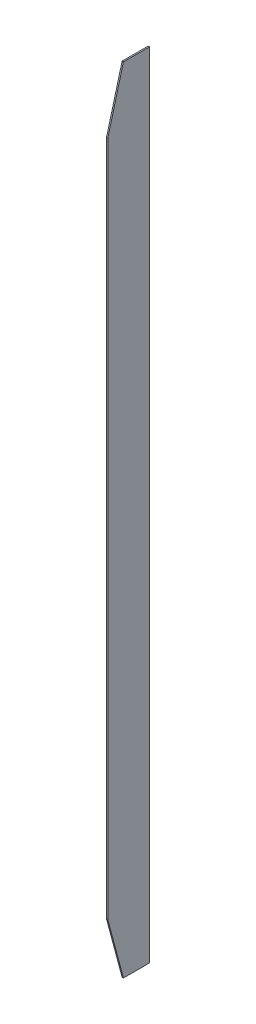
ISO-10303-21;
HEADER;
FILE_DESCRIPTION(('STEP AP214'),'2;1');
FILE_NAME('part.step','',(''),(''),'','','');
FILE_SCHEMA(('AUTOMOTIVE_DESIGN { 1 0 10303 214 1 1 1 1 }'));
ENDSEC;
DATA;
#1=APPLICATION_CONTEXT('core data for automotive mechanical design processes');
#2=APPLICATION_PROTOCOL_DEFINITION('international standard','automotive_design',2000,#1);
#3=PRODUCT_CONTEXT('',#1,'mechanical');
#4=PRODUCT('Part','Part','',(#3));
#5=PRODUCT_RELATED_PRODUCT_CATEGORY('part','',(#4));
#6=PRODUCT_DEFINITION_FORMATION('','',#4);
#7=PRODUCT_DEFINITION_CONTEXT('part definition',#1,'design');
#8=PRODUCT_DEFINITION('design','',#6,#7);
#9=PRODUCT_DEFINITION_SHAPE('','',#8);
#10=(LENGTH_UNIT() NAMED_UNIT(*) SI_UNIT(.MILLI.,.METRE.));
#11=(NAMED_UNIT(*) PLANE_ANGLE_UNIT() SI_UNIT($,.RADIAN.));
#12=(NAMED_UNIT(*) SI_UNIT($,.STERADIAN.) SOLID_ANGLE_UNIT());
#13=UNCERTAINTY_MEASURE_WITH_UNIT(LENGTH_MEASURE(1.E-05),#10,'distance_accuracy_value','');
#14=(GEOMETRIC_REPRESENTATION_CONTEXT(3) GLOBAL_UNCERTAINTY_ASSIGNED_CONTEXT((#13)) GLOBAL_UNIT_ASSIGNED_CONTEXT((#10,
#11,#12)) REPRESENTATION_CONTEXT('',''));
#15=CARTESIAN_POINT('',(0.,0.,0.));
#16=DIRECTION('',(0.,0.,1.));
#17=DIRECTION('',(1.,0.,0.));
#18=AXIS2_PLACEMENT_3D('',#15,#16,#17);
#19=CARTESIAN_POINT('',(1.58749999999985,-964.415443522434,4270.855641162));
#20=DIRECTION('',(0.,1.,0.));
#21=DIRECTION('',(0.,0.,1.));
#22=AXIS2_PLACEMENT_3D('',#19,#20,#21);
#23=PLANE('',#22);
#24=DIRECTION('',(0.,0.,-1.));
#25=VECTOR('',#24,1.);
#26=CARTESIAN_POINT('',(-1.58749999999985,-964.415443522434,4270.855641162));
#27=LINE('',#26,#25);
#28=CARTESIAN_POINT('',(-1.58749999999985,-964.415443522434,4334.355641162));
#29=VERTEX_POINT('',#28);
#30=CARTESIAN_POINT('',(-1.58749999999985,-964.415443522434,4270.855641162));
#31=VERTEX_POINT('',#30);
#32=EDGE_CURVE('E131',#29,#31,#27,.T.);
#33=ORIENTED_EDGE('',*,*,#32,.T.);
#34=DIRECTION('',(-1.,0.,0.));
#35=VECTOR('',#34,1.);
#36=CARTESIAN_POINT('',(1.58749999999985,-964.415443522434,4270.855641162));
#37=LINE('',#36,#35);
#38=CARTESIAN_POINT('',(1.58749999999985,-964.415443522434,4270.855641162));
#39=VERTEX_POINT('',#38);
#40=EDGE_CURVE('E11',#39,#31,#37,.T.);
#41=ORIENTED_EDGE('',*,*,#40,.F.);
#42=DIRECTION('',(0.,0.,-1.));
#43=VECTOR('',#42,1.);
#44=CARTESIAN_POINT('',(1.58749999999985,-964.415443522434,4270.855641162));
#45=LINE('',#44,#43);
#46=CARTESIAN_POINT('',(1.58749999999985,-964.415443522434,4334.355641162));
#47=VERTEX_POINT('',#46);
#48=EDGE_CURVE('E147',#47,#39,#45,.T.);
#49=ORIENTED_EDGE('',*,*,#48,.F.);
#50=DIRECTION('',(-1.,0.,0.));
#51=VECTOR('',#50,1.);
#52=CARTESIAN_POINT('',(1.58749999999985,-964.415443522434,4334.355641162));
#53=LINE('',#52,#51);
#54=EDGE_CURVE('E127',#47,#29,#53,.T.);
#55=ORIENTED_EDGE('',*,*,#54,.T.);
#56=EDGE_LOOP('',(#33,#41,#49,#55));
#57=FACE_BOUND('',#56,.T.);
#58=ADVANCED_FACE('F41',(#57),#23,.F.);
#59=CARTESIAN_POINT('',(1.58749999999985,-964.415443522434,4270.855641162));
#60=DIRECTION('',(0.,0.,1.));
#61=DIRECTION('',(1.,0.,0.));
#62=AXIS2_PLACEMENT_3D('',#59,#60,#61);
#63=PLANE('',#62);
#64=DIRECTION('',(0.,1.,0.));
#65=VECTOR('',#64,1.);
#66=CARTESIAN_POINT('',(-1.58749999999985,-964.415443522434,4270.855641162));
#67=LINE('',#66,#65);
#68=CARTESIAN_POINT('',(-1.58749999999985,964.415443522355,4270.855641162));
#69=VERTEX_POINT('',#68);
#70=EDGE_CURVE('E135',#31,#69,#67,.T.);
#71=ORIENTED_EDGE('',*,*,#70,.T.);
#72=DIRECTION('',(-1.,0.,0.));
#73=VECTOR('',#72,1.);
#74=CARTESIAN_POINT('',(1.58749999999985,964.415443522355,4270.855641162));
#75=LINE('',#74,#73);
#76=CARTESIAN_POINT('',(1.58749999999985,964.415443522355,4270.855641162));
#77=VERTEX_POINT('',#76);
#78=EDGE_CURVE('E50',#77,#69,#75,.T.);
#79=ORIENTED_EDGE('',*,*,#78,.F.);
#80=DIRECTION('',(0.,1.,0.));
#81=VECTOR('',#80,1.);
#82=CARTESIAN_POINT('',(1.58749999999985,-964.415443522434,4270.855641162));
#83=LINE('',#82,#81);
#84=EDGE_CURVE('E95',#39,#77,#83,.T.);
#85=ORIENTED_EDGE('',*,*,#84,.F.);
#86=ORIENTED_EDGE('',*,*,#40,.T.);
#87=EDGE_LOOP('',(#71,#79,#85,#86));
#88=FACE_BOUND('',#87,.T.);
#89=ADVANCED_FACE('F177',(#88),#63,.F.);
#90=CARTESIAN_POINT('',(1.58749999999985,964.415443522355,4334.355641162));
#91=DIRECTION('',(0.,-1.,0.));
#92=DIRECTION('',(0.,0.,-1.));
#93=AXIS2_PLACEMENT_3D('',#90,#91,#92);
#94=PLANE('',#93);
#95=DIRECTION('',(0.,0.,1.));
#96=VECTOR('',#95,1.);
#97=CARTESIAN_POINT('',(-1.58749999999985,964.415443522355,4334.355641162));
#98=LINE('',#97,#96);
#99=CARTESIAN_POINT('',(-1.58749999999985,964.415443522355,4334.355641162));
#100=VERTEX_POINT('',#99);
#101=EDGE_CURVE('E138',#69,#100,#98,.T.);
#102=ORIENTED_EDGE('',*,*,#101,.T.);
#103=DIRECTION('',(-1.,0.,0.));
#104=VECTOR('',#103,1.);
#105=CARTESIAN_POINT('',(1.58749999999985,964.415443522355,4334.355641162));
#106=LINE('',#105,#104);
#107=CARTESIAN_POINT('',(1.58749999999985,964.415443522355,4334.355641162));
#108=VERTEX_POINT('',#107);
#109=EDGE_CURVE('E119',#108,#100,#106,.T.);
#110=ORIENTED_EDGE('',*,*,#109,.F.);
#111=DIRECTION('',(0.,0.,1.));
#112=VECTOR('',#111,1.);
#113=CARTESIAN_POINT('',(1.58749999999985,964.415443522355,4334.355641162));
#114=LINE('',#113,#112);
#115=EDGE_CURVE('E108',#77,#108,#114,.T.);
#116=ORIENTED_EDGE('',*,*,#115,.F.);
#117=ORIENTED_EDGE('',*,*,#78,.T.);
#118=EDGE_LOOP('',(#102,#110,#116,#117));
#119=FACE_BOUND('',#118,.T.);
#120=ADVANCED_FACE('F158',(#119),#94,.F.);
#121=CARTESIAN_POINT('',(1.58750000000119,822.224307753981,4372.455641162));
#122=DIRECTION('',(0.,-0.258819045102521,-0.965925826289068));
#123=DIRECTION('',(0.,0.965925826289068,-0.258819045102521));
#124=AXIS2_PLACEMENT_3D('',#121,#122,#123);
#125=PLANE('',#124);
#126=DIRECTION('',(0.,-0.965925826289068,0.258819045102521));
#127=VECTOR('',#126,1.);
#128=CARTESIAN_POINT('',(-1.58749999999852,822.224307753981,4372.455641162));
#129=LINE('',#128,#127);
#130=CARTESIAN_POINT('',(-1.58749999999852,822.224307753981,4372.455641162));
#131=VERTEX_POINT('',#130);
#132=EDGE_CURVE('E117',#100,#131,#129,.T.);
#133=ORIENTED_EDGE('',*,*,#132,.T.);
#134=DIRECTION('',(-1.,0.,0.));
#135=VECTOR('',#134,1.);
#136=CARTESIAN_POINT('',(1.58750000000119,822.224307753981,4372.455641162));
#137=LINE('',#136,#135);
#138=CARTESIAN_POINT('',(1.58750000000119,822.224307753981,4372.455641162));
#139=VERTEX_POINT('',#138);
#140=EDGE_CURVE('E114',#139,#131,#137,.T.);
#141=ORIENTED_EDGE('',*,*,#140,.F.);
#142=DIRECTION('',(0.,-0.965925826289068,0.258819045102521));
#143=VECTOR('',#142,1.);
#144=CARTESIAN_POINT('',(1.58750000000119,822.224307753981,4372.455641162));
#145=LINE('',#144,#143);
#146=EDGE_CURVE('E102',#108,#139,#145,.T.);
#147=ORIENTED_EDGE('',*,*,#146,.F.);
#148=ORIENTED_EDGE('',*,*,#109,.T.);
#149=EDGE_LOOP('',(#133,#141,#147,#148));
#150=FACE_BOUND('',#149,.T.);
#151=ADVANCED_FACE('F115',(#150),#125,.F.);
#152=CARTESIAN_POINT('',(1.58750000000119,-822.22430775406,4372.455641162));
#153=DIRECTION('',(0.,0.,-1.));
#154=DIRECTION('',(-1.,0.,0.));
#155=AXIS2_PLACEMENT_3D('',#152,#153,#154);
#156=PLANE('',#155);
#157=DIRECTION('',(0.,-1.,0.));
#158=VECTOR('',#157,1.);
#159=CARTESIAN_POINT('',(-1.58749999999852,-822.22430775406,4372.455641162));
#160=LINE('',#159,#158);
#161=CARTESIAN_POINT('',(-1.58749999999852,-822.22430775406,4372.455641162));
#162=VERTEX_POINT('',#161);
#163=EDGE_CURVE('E81',#131,#162,#160,.T.);
#164=ORIENTED_EDGE('',*,*,#163,.T.);
#165=DIRECTION('',(-1.,0.,0.));
#166=VECTOR('',#165,1.);
#167=CARTESIAN_POINT('',(1.58750000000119,-822.22430775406,4372.455641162));
#168=LINE('',#167,#166);
#169=CARTESIAN_POINT('',(1.58750000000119,-822.22430775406,4372.455641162));
#170=VERTEX_POINT('',#169);
#171=EDGE_CURVE('E120',#170,#162,#168,.T.);
#172=ORIENTED_EDGE('',*,*,#171,.F.);
#173=DIRECTION('',(0.,-1.,0.));
#174=VECTOR('',#173,1.);
#175=CARTESIAN_POINT('',(1.58750000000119,-822.22430775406,4372.455641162));
#176=LINE('',#175,#174);
#177=EDGE_CURVE('E106',#139,#170,#176,.T.);
#178=ORIENTED_EDGE('',*,*,#177,.F.);
#179=ORIENTED_EDGE('',*,*,#140,.T.);
#180=EDGE_LOOP('',(#164,#172,#178,#179));
#181=FACE_BOUND('',#180,.T.);
#182=ADVANCED_FACE('F122',(#181),#156,.F.);
#183=CARTESIAN_POINT('',(1.58749999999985,-964.415443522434,4334.355641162));
#184=DIRECTION('',(0.,0.258819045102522,-0.965925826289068));
#185=DIRECTION('',(0.,0.965925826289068,0.258819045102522));
#186=AXIS2_PLACEMENT_3D('',#183,#184,#185);
#187=PLANE('',#186);
#188=DIRECTION('',(0.,-0.965925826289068,-0.258819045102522));
#189=VECTOR('',#188,1.);
#190=CARTESIAN_POINT('',(-1.58749999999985,-964.415443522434,4334.355641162));
#191=LINE('',#190,#189);
#192=EDGE_CURVE('E87',#162,#29,#191,.T.);
#193=ORIENTED_EDGE('',*,*,#192,.T.);
#194=ORIENTED_EDGE('',*,*,#54,.F.);
#195=DIRECTION('',(0.,-0.965925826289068,-0.258819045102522));
#196=VECTOR('',#195,1.);
#197=CARTESIAN_POINT('',(1.58749999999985,-964.415443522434,4334.355641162));
#198=LINE('',#197,#196);
#199=EDGE_CURVE('E58',#170,#47,#198,.T.);
#200=ORIENTED_EDGE('',*,*,#199,.F.);
#201=ORIENTED_EDGE('',*,*,#171,.T.);
#202=EDGE_LOOP('',(#193,#194,#200,#201));
#203=FACE_BOUND('',#202,.T.);
#204=ADVANCED_FACE('F165',(#203),#187,.F.);
#205=CARTESIAN_POINT('',(1.58749999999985,0.,0.));
#206=DIRECTION('',(-1.,0.,0.));
#207=DIRECTION('',(0.,0.,1.));
#208=AXIS2_PLACEMENT_3D('',#205,#206,#207);
#209=PLANE('',#208);
#210=ORIENTED_EDGE('',*,*,#48,.T.);
#211=ORIENTED_EDGE('',*,*,#84,.T.);
#212=ORIENTED_EDGE('',*,*,#115,.T.);
#213=ORIENTED_EDGE('',*,*,#146,.T.);
#214=ORIENTED_EDGE('',*,*,#177,.T.);
#215=ORIENTED_EDGE('',*,*,#199,.T.);
#216=EDGE_LOOP('',(#210,#211,#212,#213,#214,#215));
#217=FACE_BOUND('',#216,.T.);
#218=ADVANCED_FACE('F104',(#217),#209,.F.);
#219=CARTESIAN_POINT('',(-1.58749999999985,0.,0.));
#220=DIRECTION('',(-1.,0.,0.));
#221=DIRECTION('',(0.,0.,1.));
#222=AXIS2_PLACEMENT_3D('',#219,#220,#221);
#223=PLANE('',#222);
#224=ORIENTED_EDGE('',*,*,#32,.F.);
#225=ORIENTED_EDGE('',*,*,#192,.F.);
#226=ORIENTED_EDGE('',*,*,#163,.F.);
#227=ORIENTED_EDGE('',*,*,#132,.F.);
#228=ORIENTED_EDGE('',*,*,#101,.F.);
#229=ORIENTED_EDGE('',*,*,#70,.F.);
#230=EDGE_LOOP('',(#224,#225,#226,#227,#228,#229));
#231=FACE_BOUND('',#230,.T.);
#232=ADVANCED_FACE('F161',(#231),#223,.T.);
#233=CLOSED_SHELL('',(#58,#89,#120,#151,#182,#204,#218,#232));
#234=MANIFOLD_SOLID_BREP('B2',#233);
#235=ADVANCED_BREP_SHAPE_REPRESENTATION('',(#18,#234),#14);
#236=SHAPE_DEFINITION_REPRESENTATION(#9,#235);
ENDSEC;
END-ISO-10303-21;
